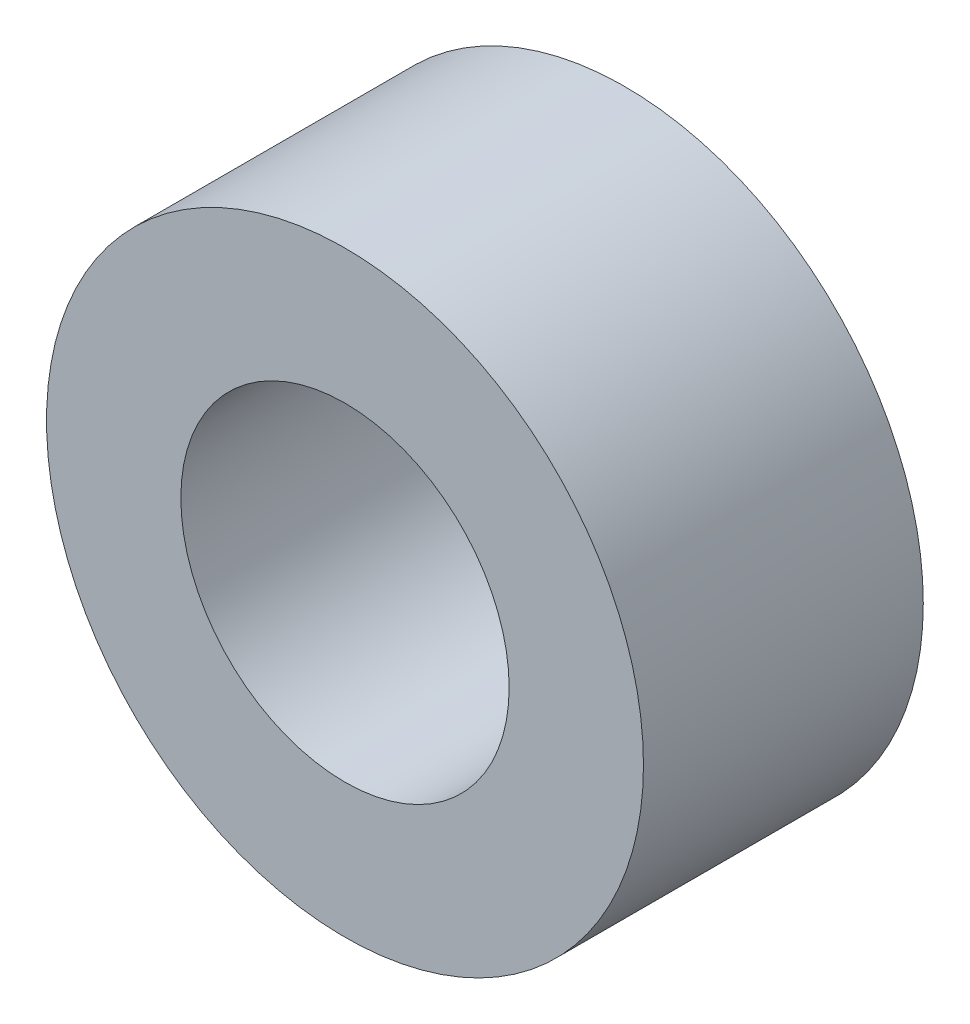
from build123d import *

# Parameters (mm, degrees)
SKETCH1_R               = 8
BOSS_EXTRUDE2_DEPTH     = 7.5
M10X1_25_TAPPED_HOLE1_D = 8.8


with BuildPart() as part:
    # Sketch1 → Boss-Extrude2 (new body)
    with BuildSketch(Plane.XY):
        Circle(SKETCH1_R)
    extrude(amount=BOSS_EXTRUDE2_DEPTH)

    # M10x1.25 Tapped Hole1 (through all)
    with Locations(Plane.XY.offset(7.5)):
        with Locations((0, 0)):
            Hole(M10X1_25_TAPPED_HOLE1_D / 2)


solid = part.part
